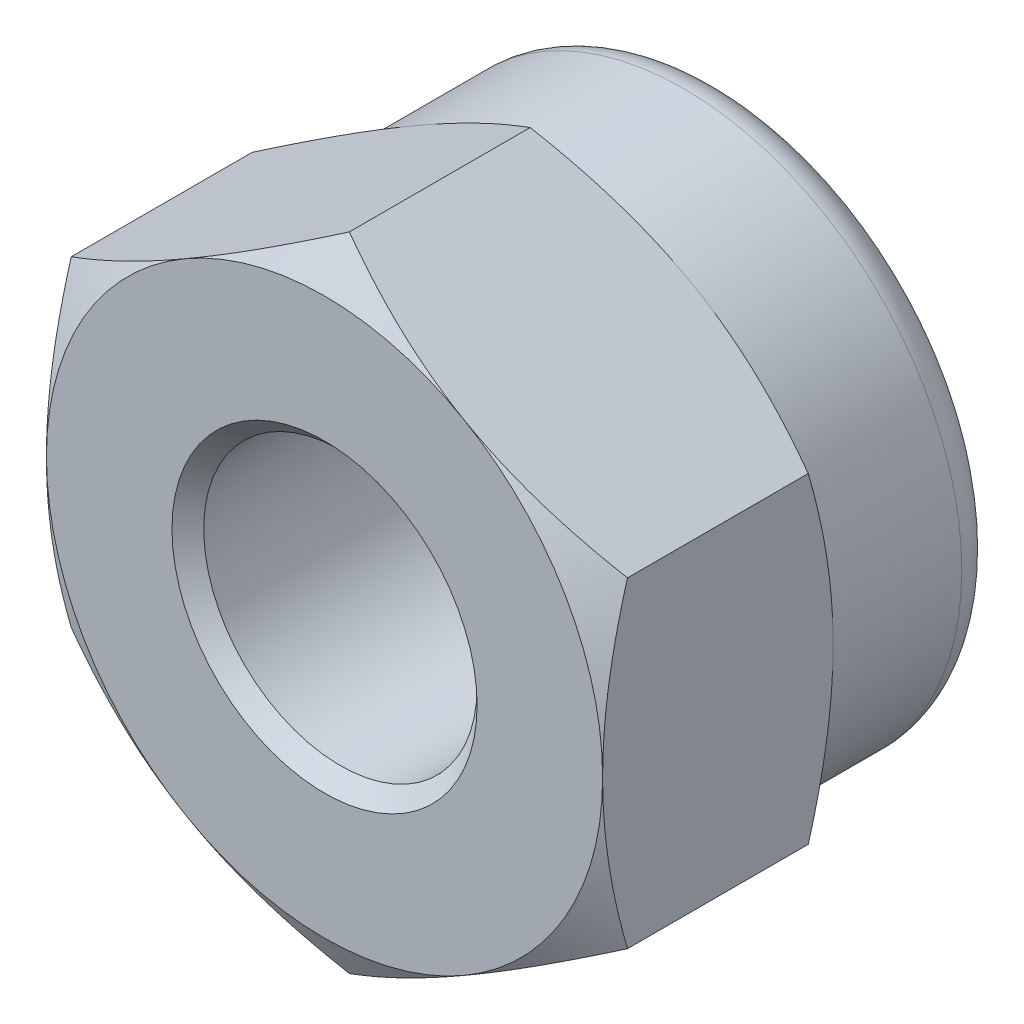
from build123d import *

# Parameters (mm, degrees)
SKETCH_7_R          = 1.72
EXTRUDE_1_DEPTH     = 2.9
SKETCH_5_R          = 3.5
SKETCH_5_R_2        = 2.2
EXTRUDE_4_DEPTH     = 2.1
FILLET_2_R          = 0.48
SKETCH_6_R          = 2.625
CUT_EXTRUDE_1_DEPTH = 0.525
FILLET_3_R          = 0.1
CHAMFER_2_SIZE      = 0.2


with BuildPart() as part:
    # Sketch 7 → Extrude 1 (new body)
    with BuildSketch(Plane.XY):
        Polygon((0, 4.041451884), (-3.5, 2.020725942), (-3.5, -2.020725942), (0, -4.041451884), (3.5, -2.020725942), (3.5, 2.020725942), align=None)
        Circle(SKETCH_7_R, mode=Mode.SUBTRACT)
    extrude(amount=-EXTRUDE_1_DEPTH)

    # Sketch 2 → Cut-Revolve 1 (revolve, cut)
    with BuildSketch(Plane(origin=(0, 0, 0), x_dir=(0, 0, -1), z_dir=(1, 0, 0))):
        Polygon((0, 3.5), (0.312607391, 4.041451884), (0, 4.041451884), align=None)
        Polygon((2.9, 3.5), (2.587392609, 4.041451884), (2.9, 4.041451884), align=None)
    revolve(axis=Axis((0, 0, 0), (0, 0, -1)), mode=Mode.SUBTRACT)

    # Sketch 5 → Extrude 4 (add)
    with BuildSketch(Plane(origin=(0, 0, -2.9), x_dir=(-1, 0, 0), z_dir=(0, 0, -1))):
        Circle(SKETCH_5_R)
        Circle(SKETCH_5_R_2, mode=Mode.SUBTRACT)
    extrude(amount=EXTRUDE_4_DEPTH)

    # Fillet 2
    fillet_2_edges = [part.edges().sort_by_distance(p)[0] for p in [
        (3.5, 0, -5),
    ]]
    fillet(fillet_2_edges, radius=FILLET_2_R)

    # Sketch 6 → Cut-Extrude 1 (cut)
    with BuildSketch(Plane(origin=(0, 0, -5), x_dir=(-1, 0, 0), z_dir=(0, 0, -1))):
        Circle(SKETCH_6_R)
    extrude(amount=-CUT_EXTRUDE_1_DEPTH, mode=Mode.SUBTRACT)

    # Fillet 3
    fillet_3_edges = [part.edges().sort_by_distance(p)[0] for p in [
        (2.625, 0, -5),
    ]]
    fillet(fillet_3_edges, radius=FILLET_3_R)

    # Chamfer 2
    chamfer_2_edges = [part.edges().sort_by_distance(p)[0] for p in [
        (-1.72, 0, -2.9),
        (-1.72, 0, 0),
    ]]
    chamfer(chamfer_2_edges, length=CHAMFER_2_SIZE)


solid = part.part
